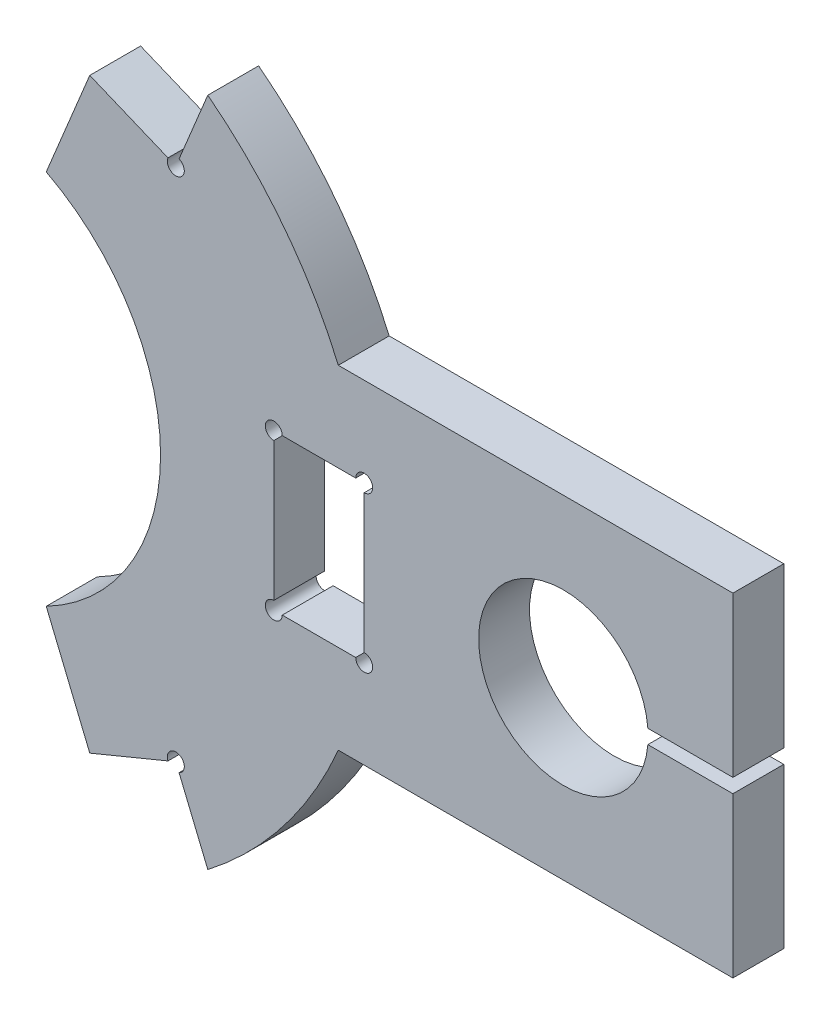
from build123d import *

# Parameters (mm, degrees)
BOSS_EXTRUDE1_DEPTH = 18
CUT_EXTRUDE1_DEPTH  = 302.611696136
SKETCH5_W           = 32
SKETCH5_H           = 55
CUT_EXTRUDE2_DEPTH  = 302.611696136
SKETCH6_R           = 3
CUT_EXTRUDE3_DEPTH  = 302.611696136


with BuildPart() as part:
    # Sketch3 → Boss-Extrude1 (new body)
    with BuildSketch(Plane.XY):
        with BuildLine():
            Line((90.828030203, 118.688753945), (79.510463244, 91.292400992))
            Line((79.510463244, 91.292400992), (49.051159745, 103.875287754))
            Line((49.051159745, 103.875287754), (33.642228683, 66.574999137))
            ThreePointArc((33.642228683, 66.574999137), (74.105733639, 0), (33.642228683, -66.574999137))
            Line((33.642228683, -66.574999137), (49.051159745, -103.875287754))
            Line((49.051159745, -103.875287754), (79.510463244, -91.292400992))
            Line((79.510463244, -91.292400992), (90.828030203, -118.688753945))
            ThreePointArc((90.828030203, -118.688753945), (117.740260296, -91.792423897), (137.01938308, -58.990044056))
            Line((137.01938308, -58.990044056), (276.692238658, -58.990044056))
            Line((276.692238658, -58.990044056), (276.692238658, 58.990044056))
            Line((276.692238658, 58.990044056), (137.01938308, 58.990044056))
            ThreePointArc((137.01938308, 58.990044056), (117.740260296, 91.792423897), (90.828030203, 118.688753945))
        make_face()
    extrude(amount=BOSS_EXTRUDE1_DEPTH)

    # Sketch4 → Cut-Extrude1 (cut, through all)
    with BuildSketch(Plane(origin=(0, 0, 0), x_dir=(-1, 0, 0), z_dir=(0, 0, -1))):
        with BuildLine():
            Line((-246.587890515, 2.5), (-276.692238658, 2.5))
            Line((-276.692238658, 2.5), (-276.692238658, -2.5))
            Line((-276.692238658, -2.5), (-246.587890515, -2.5))
            ThreePointArc((-246.587890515, -2.5), (-186.692238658, 0), (-246.587890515, 2.5))
        make_face()
    extrude(amount=-CUT_EXTRUDE1_DEPTH, mode=Mode.SUBTRACT)

    # Sketch5 → Cut-Extrude2 (cut, through all)
    with BuildSketch(Plane(origin=(0, 0, 0), x_dir=(-1, 0, 0), z_dir=(0, 0, -1))):
        with Locations((-130.182655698, 0)):
            Rectangle(SKETCH5_W, SKETCH5_H)
    extrude(amount=-CUT_EXTRUDE2_DEPTH, mode=Mode.SUBTRACT)

    # Sketch6 → Cut-Extrude3 (cut, through all)
    with BuildSketch(Plane(origin=(0, 0, 0), x_dir=(-1, 0, 0), z_dir=(0, 0, -1))):
        with Locations((-79.510463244, 91.292400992)):
            Circle(SKETCH6_R)
        with Locations((-114.182655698, 27.5)):
            Circle(SKETCH6_R)
        with Locations((-146.182655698, 27.5)):
            Circle(SKETCH6_R)
        with Locations((-114.182655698, -27.5)):
            Circle(SKETCH6_R)
        with Locations((-146.182655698, -27.5)):
            Circle(SKETCH6_R)
        with Locations((-79.510463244, -91.292400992)):
            Circle(SKETCH6_R)
    extrude(amount=-CUT_EXTRUDE3_DEPTH, mode=Mode.SUBTRACT)


solid = part.part
